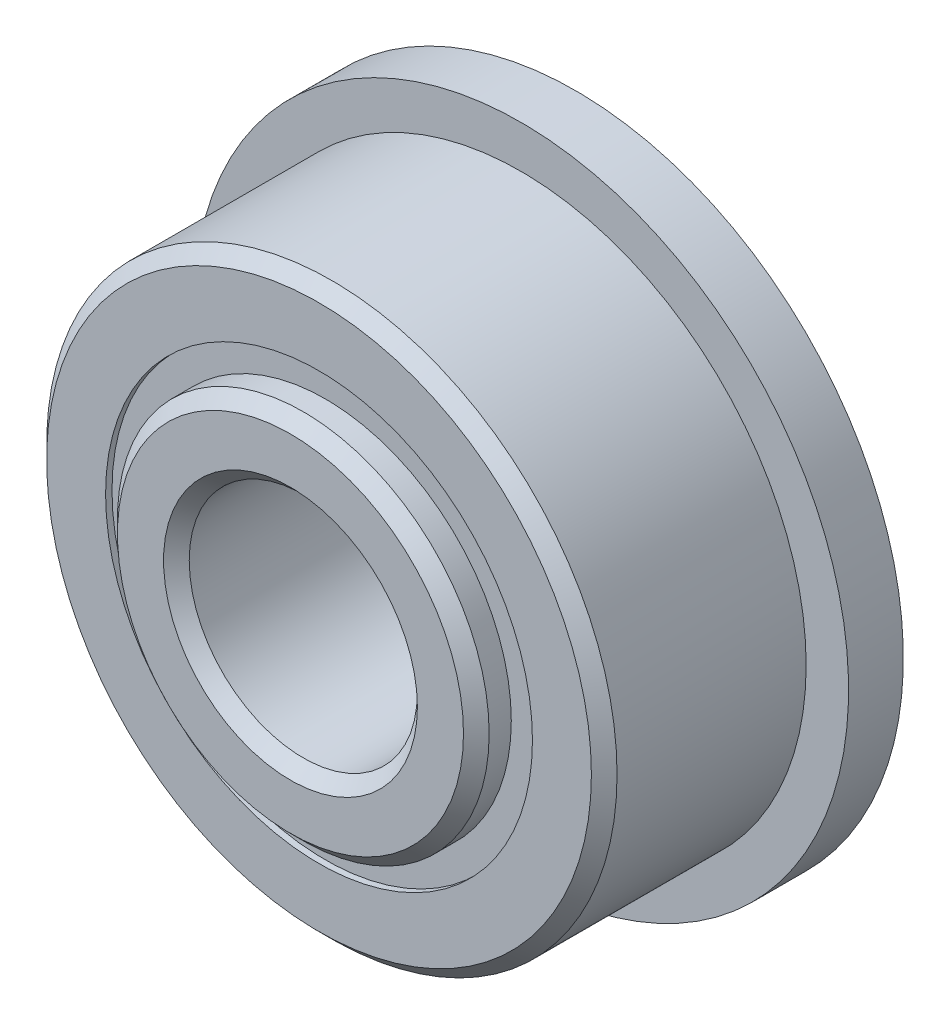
from build123d import *

# Parameters (mm, degrees)
CIRPATTERN1_COUNT = 10
SKETCH5_W         = 0.880023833
SKETCH5_H         = 0.383791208
SKETCH6_W         = 0.762
SKETCH6_H         = 1.589279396


with BuildPart() as part:
    # Sketch1 → Revolve1 (revolve)
    with BuildSketch(Plane(origin=(0, 0, 0), x_dir=(0, 0, -1), z_dir=(1, 0, 0)), mode=Mode.PRIVATE) as revolve1_sk:
        with BuildLine():
            Line((1.60734375, 3.96875), (-1.60734375, 3.96875))
            Line((-1.60734375, 3.96875), (-1.7859375, 3.79015625))
            Line((-1.7859375, 3.79015625), (-1.7859375, 2.970020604))
            Line((-1.7859375, 2.970020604), (-0.79375, 2.970020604))
            ThreePointArc((-0.79375, 2.970020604), (0, 3.594741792), (0.79375, 2.970020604))
            Line((0.79375, 2.970020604), (1.7859375, 2.970020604))
            Line((1.7859375, 2.970020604), (1.7859375, 3.79015625))
            Line((1.7859375, 3.79015625), (1.60734375, 3.96875))
        make_face()
    revolve(revolve1_sk.sketch.rotate(Axis((0, 0, 1.7859375), (0, 0, -1)), 90), axis=Axis((0, 0, 1.7859375), (0, 0, -1)))

    # Sketch6 → Revolve6 (revolve)
    with BuildSketch(Plane(origin=(0, 0, 0), x_dir=(0, 0, -1), z_dir=(1, 0, 0)), mode=Mode.PRIVATE) as revolve6_sk:
        with Locations((1.4049375, 3.764660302)):
            Rectangle(SKETCH6_W, SKETCH6_H)
    revolve(revolve6_sk.sketch.rotate(Axis((0, 0, -1.7859375), (0, 0, 1)), 270), axis=Axis((0, 0, -1.7859375), (0, 0, 1)))


with BuildPart() as body_2:
    # Sketch3 → Revolve3 (revolve)
    with BuildSketch(Plane(origin=(0, 0, 0), x_dir=(0, 0, -1), z_dir=(1, 0, 0)), mode=Mode.PRIVATE) as revolve3_sk:
        with BuildLine():
            Line((-2.18313, 1.76609375), (-2.18313, 2.407635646))
            Line((-2.18313, 2.407635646), (-2.00453625, 2.586229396))
            Line((-2.00453625, 2.586229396), (-0.79375, 2.586229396))
            ThreePointArc((-0.79375, 2.586229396), (0, 1.961508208), (0.79375, 2.586229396))
            Line((0.79375, 2.586229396), (2.00453625, 2.586229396))
            Line((2.00453625, 2.586229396), (2.18313, 2.407635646))
            Line((2.18313, 2.407635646), (2.18313, 1.76609375))
            Line((2.18313, 1.76609375), (2.00453625, 1.5875))
            Line((2.00453625, 1.5875), (-2.00453625, 1.5875))
            Line((-2.00453625, 1.5875), (-2.18313, 1.76609375))
        make_face()
    revolve(revolve3_sk.sketch.rotate(Axis((0, 0, 1.7859375), (0, 0, -1)), 90), axis=Axis((0, 0, 1.7859375), (0, 0, -1)))


with BuildPart() as body_3:
    # Sketch4 → Revolve4 (revolve)
    with BuildSketch(Plane(origin=(0, 0, 0), x_dir=(0, 0, -1), z_dir=(1, 0, 0))):
        with BuildLine():
            Line((-0.816616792, 2.778125), (0.816616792, 2.778125))
            ThreePointArc((0.816616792, 2.778125), (0, 3.594741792), (-0.816616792, 2.778125))
        make_face()
    revolve(axis=Axis((0, 2.778125, 0.816616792), (0, 0, -1)))


with BuildPart() as cirpattern1_1:
    # CirPattern1: pattern copy
    add(body_3.part.rotate(Axis((0, 0, 0), (0, 0, 1)), 1 * 360 / CIRPATTERN1_COUNT))


with BuildPart() as cirpattern1_2:
    # CirPattern1: pattern copy
    add(body_3.part.rotate(Axis((0, 0, 0), (0, 0, 1)), 2 * 360 / CIRPATTERN1_COUNT))


with BuildPart() as cirpattern1_3:
    # CirPattern1: pattern copy
    add(body_3.part.rotate(Axis((0, 0, 0), (0, 0, 1)), 3 * 360 / CIRPATTERN1_COUNT))


with BuildPart() as cirpattern1_4:
    # CirPattern1: pattern copy
    add(body_3.part.rotate(Axis((0, 0, 0), (0, 0, 1)), 4 * 360 / CIRPATTERN1_COUNT))


with BuildPart() as cirpattern1_5:
    # CirPattern1: pattern copy
    add(body_3.part.rotate(Axis((0, 0, 0), (0, 0, 1)), 5 * 360 / CIRPATTERN1_COUNT))


with BuildPart() as cirpattern1_6:
    # CirPattern1: pattern copy
    add(body_3.part.rotate(Axis((0, 0, 0), (0, 0, 1)), 6 * 360 / CIRPATTERN1_COUNT))


with BuildPart() as cirpattern1_7:
    # CirPattern1: pattern copy
    add(body_3.part.rotate(Axis((0, 0, 0), (0, 0, 1)), 7 * 360 / CIRPATTERN1_COUNT))


with BuildPart() as cirpattern1_8:
    # CirPattern1: pattern copy
    add(body_3.part.rotate(Axis((0, 0, 0), (0, 0, 1)), 8 * 360 / CIRPATTERN1_COUNT))


with BuildPart() as cirpattern1_9:
    # CirPattern1: pattern copy
    add(body_3.part.rotate(Axis((0, 0, 0), (0, 0, 1)), 9 * 360 / CIRPATTERN1_COUNT))


with BuildPart() as body_13:
    # Sketch5 → Revolve5 (revolve)
    with BuildSketch(Plane(origin=(0, 0, 0), x_dir=(0, 0, -1), z_dir=(1, 0, 0)), mode=Mode.PRIVATE) as revolve5_sk:
        with Locations((-1.256628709, 2.778125)):
            Rectangle(SKETCH5_W, SKETCH5_H)
        with Locations((1.256628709, 2.778125)):
            Rectangle(SKETCH5_W, SKETCH5_H)
    revolve(revolve5_sk.sketch.rotate(Axis((0, 0, 1.7859375), (0, 0, -1)), 90), axis=Axis((0, 0, 1.7859375), (0, 0, -1)))


solid = Compound([part.part, body_2.part, body_3.part, cirpattern1_1.part, cirpattern1_2.part, cirpattern1_3.part, cirpattern1_4.part, cirpattern1_5.part, cirpattern1_6.part, cirpattern1_7.part, cirpattern1_8.part, cirpattern1_9.part, body_13.part])
